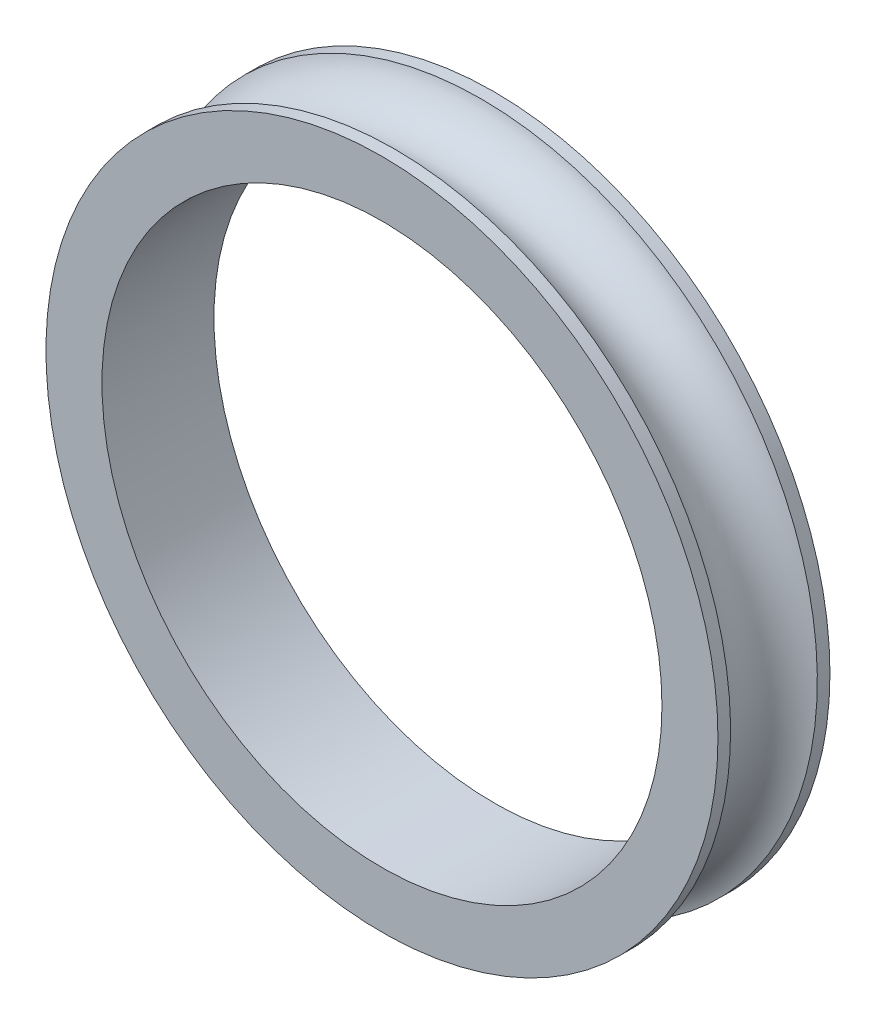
from build123d import *

# Parameters (mm, degrees)
SKETCH_1_R          = 30
EXTRUDE_2_DEPTH     = 10
SKETCH_2_R          = 25
CUT_EXTRUDE_5_DEPTH = 10


with BuildPart() as part:
    # Sketch 1 → Extrude 2 (new body)
    with BuildSketch(Plane.XY):
        Circle(SKETCH_1_R)
    extrude(amount=EXTRUDE_2_DEPTH)

    # Sketch 2 → Cut-Extrude 5 (cut)
    with BuildSketch(Plane.XY):
        Circle(SKETCH_2_R)
    extrude(amount=CUT_EXTRUDE_5_DEPTH, mode=Mode.SUBTRACT)

    # Sketch 4 → Cut-Revolve 2 (revolve, cut)
    with BuildSketch(Plane(origin=(0, 0, 0), x_dir=(0, 0, -1), z_dir=(1, 0, 0)), mode=Mode.PRIVATE) as cut_revolve_2_sk:
        with BuildLine():
            Line((-1.127016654, -30), (-8.872983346, -30))
            ThreePointArc((-8.872983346, -30), (-5, -27), (-1.127016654, -30))
        make_face()
    revolve(cut_revolve_2_sk.sketch.rotate(Axis((0, 0, 0), (0, 0, 1)), 180), axis=Axis((0, 0, 0), (0, 0, 1)), mode=Mode.SUBTRACT)


solid = part.part
